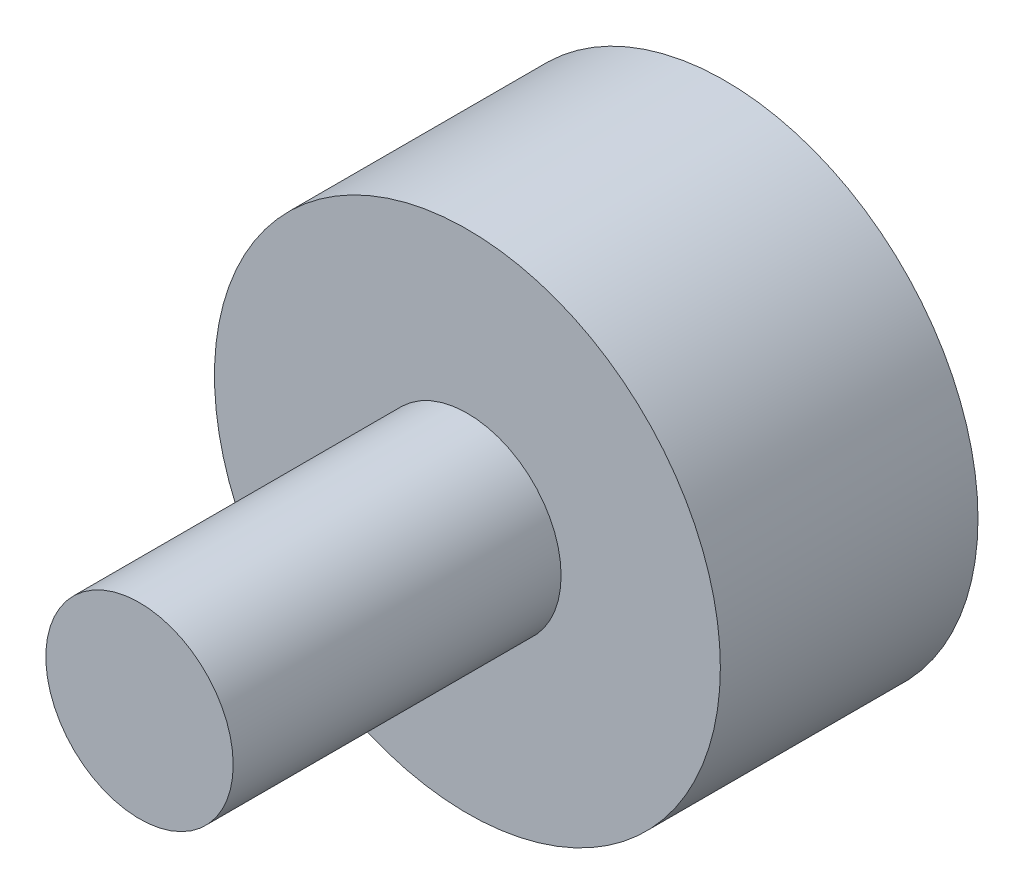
from build123d import *

# Parameters (mm, degrees)
ESQUISSE1_R        = 21.6
ESQUISSE1_R_2      = 8
BOSS_EXTRU_1_DEPTH = 22
ESQUISSE1_4_R      = 8
BOSS_EXTRU_2_DEPTH = 50


with BuildPart() as part:
    # Esquisse1 → Boss.-Extru.1 (new body)
    with BuildSketch(Plane.XY):
        Circle(ESQUISSE1_R)
        Circle(ESQUISSE1_R_2, mode=Mode.SUBTRACT)
    extrude(amount=BOSS_EXTRU_1_DEPTH)

    # Esquisse1_4 → Boss.-Extru.2 (add)
    with BuildSketch(Plane.XY):
        Circle(ESQUISSE1_4_R)
    extrude(amount=BOSS_EXTRU_2_DEPTH)


solid = part.part
